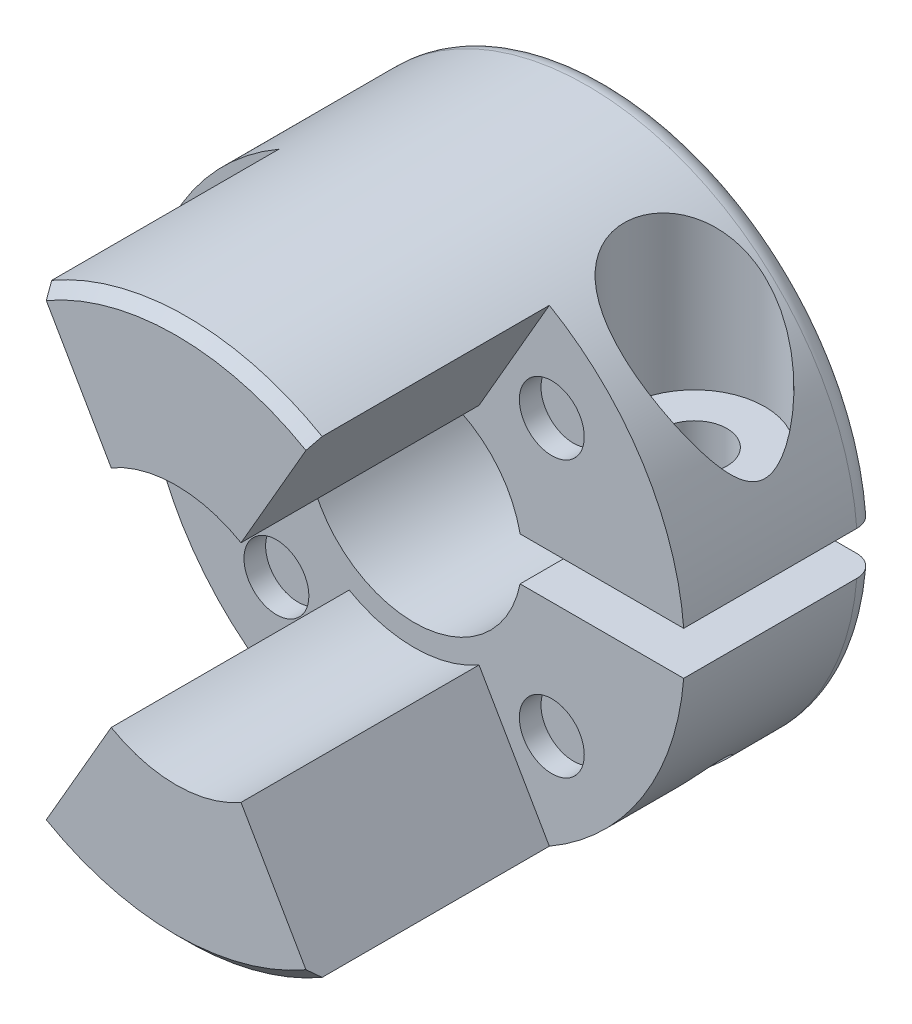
ISO-10303-21;
HEADER;
FILE_DESCRIPTION(('STEP AP214'),'2;1');
FILE_NAME('part.step','',(''),(''),'','','');
FILE_SCHEMA(('AUTOMOTIVE_DESIGN { 1 0 10303 214 1 1 1 1 }'));
ENDSEC;
DATA;
#1=APPLICATION_CONTEXT('core data for automotive mechanical design processes');
#2=APPLICATION_PROTOCOL_DEFINITION('international standard','automotive_design',2000,#1);
#3=PRODUCT_CONTEXT('',#1,'mechanical');
#4=PRODUCT('Part','Part','',(#3));
#5=PRODUCT_RELATED_PRODUCT_CATEGORY('part','',(#4));
#6=PRODUCT_DEFINITION_FORMATION('','',#4);
#7=PRODUCT_DEFINITION_CONTEXT('part definition',#1,'design');
#8=PRODUCT_DEFINITION('design','',#6,#7);
#9=PRODUCT_DEFINITION_SHAPE('','',#8);
#10=(LENGTH_UNIT() NAMED_UNIT(*) SI_UNIT(.MILLI.,.METRE.));
#11=(NAMED_UNIT(*) PLANE_ANGLE_UNIT() SI_UNIT($,.RADIAN.));
#12=(NAMED_UNIT(*) SI_UNIT($,.STERADIAN.) SOLID_ANGLE_UNIT());
#13=UNCERTAINTY_MEASURE_WITH_UNIT(LENGTH_MEASURE(1.E-05),#10,'distance_accuracy_value','');
#14=(GEOMETRIC_REPRESENTATION_CONTEXT(3) GLOBAL_UNCERTAINTY_ASSIGNED_CONTEXT((#13)) GLOBAL_UNIT_ASSIGNED_CONTEXT((#10,
#11,#12)) REPRESENTATION_CONTEXT('',''));
#15=CARTESIAN_POINT('',(0.,0.,0.));
#16=DIRECTION('',(0.,0.,1.));
#17=DIRECTION('',(1.,0.,0.));
#18=AXIS2_PLACEMENT_3D('',#15,#16,#17);
#19=CARTESIAN_POINT('',(8.45993579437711,4.,4.5));
#20=DIRECTION('',(0.,-1.,0.));
#21=DIRECTION('',(0.,0.,-1.));
#22=AXIS2_PLACEMENT_3D('',#19,#20,#21);
#23=PLANE('',#22);
#24=CARTESIAN_POINT('',(8.45993579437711,4.,4.5));
#25=DIRECTION('',(0.,-1.,0.));
#26=DIRECTION('',(0.,0.,-1.));
#27=AXIS2_PLACEMENT_3D('',#24,#25,#26);
#28=CIRCLE('',#27,3.25);
#29=CARTESIAN_POINT('',(8.45993579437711,4.,1.25));
#30=VERTEX_POINT('',#29);
#31=EDGE_CURVE('E476',#30,#30,#28,.F.);
#32=ORIENTED_EDGE('',*,*,#31,.T.);
#33=EDGE_LOOP('',(#32));
#34=FACE_BOUND('',#33,.T.);
#35=CARTESIAN_POINT('',(8.45993579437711,4.,4.5));
#36=DIRECTION('',(0.,1.,0.));
#37=DIRECTION('',(0.,0.,1.));
#38=AXIS2_PLACEMENT_3D('',#35,#36,#37);
#39=CIRCLE('',#38,1.5);
#40=CARTESIAN_POINT('',(8.45993579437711,4.,6.));
#41=VERTEX_POINT('',#40);
#42=EDGE_CURVE('E20',#41,#41,#39,.F.);
#43=ORIENTED_EDGE('',*,*,#42,.T.);
#44=EDGE_LOOP('',(#43));
#45=FACE_BOUND('',#44,.T.);
#46=ADVANCED_FACE('F17',(#34,#45),#23,.F.);
#47=CARTESIAN_POINT('',(6.36396103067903,6.36396103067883,8.));
#48=DIRECTION('',(0.,0.,1.));
#49=DIRECTION('',(1.,0.,0.));
#50=AXIS2_PLACEMENT_3D('',#47,#48,#49);
#51=PLANE('',#50);
#52=CARTESIAN_POINT('',(6.36396103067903,6.36396103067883,8.));
#53=DIRECTION('',(0.,0.,1.));
#54=DIRECTION('',(1.,0.,0.));
#55=AXIS2_PLACEMENT_3D('',#52,#53,#54);
#56=CIRCLE('',#55,1.5);
#57=CARTESIAN_POINT('',(7.86396103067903,6.36396103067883,8.));
#58=VERTEX_POINT('',#57);
#59=EDGE_CURVE('E713',#58,#58,#56,.T.);
#60=ORIENTED_EDGE('',*,*,#59,.T.);
#61=EDGE_LOOP('',(#60));
#62=FACE_BOUND('',#61,.T.);
#63=ADVANCED_FACE('F525',(#62),#51,.T.);
#64=CARTESIAN_POINT('',(-6.36396103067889,6.36396103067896,8.));
#65=DIRECTION('',(0.,0.,1.));
#66=DIRECTION('',(1.,0.,0.));
#67=AXIS2_PLACEMENT_3D('',#64,#65,#66);
#68=PLANE('',#67);
#69=CARTESIAN_POINT('',(-6.36396103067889,6.36396103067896,8.));
#70=DIRECTION('',(0.,0.,1.));
#71=DIRECTION('',(1.,0.,0.));
#72=AXIS2_PLACEMENT_3D('',#69,#70,#71);
#73=CIRCLE('',#72,1.5);
#74=CARTESIAN_POINT('',(-4.86396103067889,6.36396103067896,8.));
#75=VERTEX_POINT('',#74);
#76=EDGE_CURVE('E710',#75,#75,#73,.T.);
#77=ORIENTED_EDGE('',*,*,#76,.T.);
#78=EDGE_LOOP('',(#77));
#79=FACE_BOUND('',#78,.T.);
#80=ADVANCED_FACE('F518',(#79),#68,.T.);
#81=CARTESIAN_POINT('',(-6.36396103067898,-6.36396103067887,8.));
#82=DIRECTION('',(0.,0.,1.));
#83=DIRECTION('',(1.,0.,0.));
#84=AXIS2_PLACEMENT_3D('',#81,#82,#83);
#85=PLANE('',#84);
#86=CARTESIAN_POINT('',(-6.36396103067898,-6.36396103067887,8.));
#87=DIRECTION('',(0.,0.,1.));
#88=DIRECTION('',(1.,0.,0.));
#89=AXIS2_PLACEMENT_3D('',#86,#87,#88);
#90=CIRCLE('',#89,1.5);
#91=CARTESIAN_POINT('',(-4.86396103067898,-6.36396103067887,8.));
#92=VERTEX_POINT('',#91);
#93=EDGE_CURVE('E705',#92,#92,#90,.T.);
#94=ORIENTED_EDGE('',*,*,#93,.T.);
#95=EDGE_LOOP('',(#94));
#96=FACE_BOUND('',#95,.T.);
#97=ADVANCED_FACE('F511',(#96),#85,.T.);
#98=CARTESIAN_POINT('',(8.45993579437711,-12.501,4.5));
#99=DIRECTION('',(0.,1.,0.));
#100=DIRECTION('',(0.,0.,1.));
#101=AXIS2_PLACEMENT_3D('',#98,#99,#100);
#102=CYLINDRICAL_SURFACE('',#101,1.5);
#103=ORIENTED_EDGE('',*,*,#42,.F.);
#104=EDGE_LOOP('',(#103));
#105=FACE_BOUND('',#104,.T.);
#106=CARTESIAN_POINT('',(8.45993579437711,1.,4.5));
#107=DIRECTION('',(0.,1.,0.));
#108=DIRECTION('',(0.,0.,1.));
#109=AXIS2_PLACEMENT_3D('',#106,#107,#108);
#110=CIRCLE('',#109,1.5);
#111=CARTESIAN_POINT('',(8.45993579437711,1.,6.));
#112=VERTEX_POINT('',#111);
#113=EDGE_CURVE('E170',#112,#112,#110,.F.);
#114=ORIENTED_EDGE('',*,*,#113,.T.);
#115=EDGE_LOOP('',(#114));
#116=FACE_BOUND('',#115,.T.);
#117=ADVANCED_FACE('F306',(#105,#116),#102,.F.);
#118=CARTESIAN_POINT('',(0.,0.,0.));
#119=DIRECTION('',(0.,0.,-1.));
#120=DIRECTION('',(-1.,0.,0.));
#121=AXIS2_PLACEMENT_3D('',#118,#119,#120);
#122=CONICAL_SURFACE('',#121,5.49999999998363,0.785398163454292);
#123=CARTESIAN_POINT('',(0.,0.,0.500000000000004));
#124=DIRECTION('',(0.,0.,-1.));
#125=DIRECTION('',(-1.,0.,0.));
#126=AXIS2_PLACEMENT_3D('',#123,#124,#125);
#127=CIRCLE('',#126,5.);
#128=CARTESIAN_POINT('',(4.89897948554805,1.,0.499999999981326));
#129=VERTEX_POINT('',#128);
#130=CARTESIAN_POINT('',(4.89897948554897,-1.,0.499999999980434));
#131=VERTEX_POINT('',#130);
#132=EDGE_CURVE('E145',#129,#131,#127,.F.);
#133=ORIENTED_EDGE('',*,*,#132,.T.);
#134=CARTESIAN_POINT('',(5.40832691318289,-1.,-3.49652403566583E-12));
#135=CARTESIAN_POINT('',(5.32351054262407,-1.,0.0834095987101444));
#136=CARTESIAN_POINT('',(5.23865673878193,-1.,0.166781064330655));
#137=CARTESIAN_POINT('',(5.06887426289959,-1.,0.333447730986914));
#138=CARTESIAN_POINT('',(4.98394559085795,-1.,0.416742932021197));
#139=CARTESIAN_POINT('',(4.89897948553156,-1.,0.499999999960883));
#140=B_SPLINE_CURVE_WITH_KNOTS('',3,(#134,#135,#136,#137,#138,#139),.UNSPECIFIED.,.F.,.F.,(4,2,
4),(0.,0.356873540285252,0.713747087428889),.UNSPECIFIED.);
#141=CARTESIAN_POINT('',(5.40832691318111,-1.,-1.74825632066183E-12));
#142=VERTEX_POINT('',#141);
#143=EDGE_CURVE('E133',#142,#131,#140,.T.);
#144=ORIENTED_EDGE('',*,*,#143,.F.);
#145=CARTESIAN_POINT('',(0.,0.,0.));
#146=DIRECTION('',(0.,0.,-1.));
#147=DIRECTION('',(-1.,0.,0.));
#148=AXIS2_PLACEMENT_3D('',#145,#146,#147);
#149=CIRCLE('',#148,5.49999999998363);
#150=CARTESIAN_POINT('',(5.40832691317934,1.,0.));
#151=VERTEX_POINT('',#150);
#152=EDGE_CURVE('E127',#142,#151,#149,.T.);
#153=ORIENTED_EDGE('',*,*,#152,.T.);
#154=CARTESIAN_POINT('',(5.40832691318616,1.,-6.71546443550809E-12));
#155=CARTESIAN_POINT('',(5.32351054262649,1.,0.0834095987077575));
#156=CARTESIAN_POINT('',(5.23865673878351,1.,0.1667810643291));
#157=CARTESIAN_POINT('',(5.06887426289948,1.,0.33344773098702));
#158=CARTESIAN_POINT('',(4.98394559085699,1.,0.416742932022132));
#159=CARTESIAN_POINT('',(4.89897948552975,1.,0.499999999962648));
#160=B_SPLINE_CURVE_WITH_KNOTS('',3,(#154,#155,#156,#157,#158,#159),.UNSPECIFIED.,.F.,.F.,(4,2,
4),(0.,0.356873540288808,0.713747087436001),.UNSPECIFIED.);
#161=EDGE_CURVE('E148',#151,#129,#160,.T.);
#162=ORIENTED_EDGE('',*,*,#161,.T.);
#163=EDGE_LOOP('',(#133,#144,#153,#162));
#164=FACE_BOUND('',#163,.T.);
#165=ADVANCED_FACE('F146',(#164),#122,.F.);
#166=CARTESIAN_POINT('',(0.,0.,20.));
#167=DIRECTION('',(0.,0.,1.));
#168=DIRECTION('',(1.,0.,0.));
#169=AXIS2_PLACEMENT_3D('',#166,#167,#168);
#170=PLANE('',#169);
#171=CARTESIAN_POINT('',(0.,0.,20.));
#172=DIRECTION('',(0.,0.,-1.));
#173=DIRECTION('',(-1.,0.,0.));
#174=AXIS2_PLACEMENT_3D('',#171,#172,#173);
#175=CIRCLE('',#174,12.);
#176=CARTESIAN_POINT('',(-6.00000000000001,10.3923048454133,20.));
#177=VERTEX_POINT('',#176);
#178=CARTESIAN_POINT('',(6.00000000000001,10.3923048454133,20.));
#179=VERTEX_POINT('',#178);
#180=EDGE_CURVE('E143',#177,#179,#175,.T.);
#181=ORIENTED_EDGE('',*,*,#180,.F.);
#182=DIRECTION('',(0.500000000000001,-0.866025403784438,0.));
#183=VECTOR('',#182,1.);
#184=CARTESIAN_POINT('',(0.,0.,20.));
#185=LINE('',#184,#183);
#186=CARTESIAN_POINT('',(-3.,5.19615242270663,20.));
#187=VERTEX_POINT('',#186);
#188=EDGE_CURVE('E152',#187,#177,#185,.F.);
#189=ORIENTED_EDGE('',*,*,#188,.F.);
#190=CARTESIAN_POINT('',(0.,0.,20.));
#191=DIRECTION('',(0.,0.,1.));
#192=DIRECTION('',(1.,0.,0.));
#193=AXIS2_PLACEMENT_3D('',#190,#191,#192);
#194=CIRCLE('',#193,6.);
#195=CARTESIAN_POINT('',(3.00000000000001,5.19615242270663,20.));
#196=VERTEX_POINT('',#195);
#197=EDGE_CURVE('E299',#187,#196,#194,.F.);
#198=ORIENTED_EDGE('',*,*,#197,.T.);
#199=DIRECTION('',(-0.500000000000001,-0.866025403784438,0.));
#200=VECTOR('',#199,1.);
#201=CARTESIAN_POINT('',(0.,0.,20.));
#202=LINE('',#201,#200);
#203=EDGE_CURVE('E386',#196,#179,#202,.F.);
#204=ORIENTED_EDGE('',*,*,#203,.T.);
#205=EDGE_LOOP('',(#181,#189,#198,#204));
#206=FACE_BOUND('',#205,.T.);
#207=ADVANCED_FACE('F305',(#206),#170,.T.);
#208=CARTESIAN_POINT('',(6.36396103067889,-6.36396103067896,8.));
#209=DIRECTION('',(0.,0.,1.));
#210=DIRECTION('',(1.,0.,0.));
#211=AXIS2_PLACEMENT_3D('',#208,#209,#210);
#212=PLANE('',#211);
#213=CARTESIAN_POINT('',(6.36396103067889,-6.36396103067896,8.));
#214=DIRECTION('',(0.,0.,1.));
#215=DIRECTION('',(1.,0.,0.));
#216=AXIS2_PLACEMENT_3D('',#213,#214,#215);
#217=CIRCLE('',#216,1.5);
#218=CARTESIAN_POINT('',(7.86396103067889,-6.36396103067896,8.));
#219=VERTEX_POINT('',#218);
#220=EDGE_CURVE('E397',#219,#219,#217,.T.);
#221=ORIENTED_EDGE('',*,*,#220,.T.);
#222=EDGE_LOOP('',(#221));
#223=FACE_BOUND('',#222,.T.);
#224=ADVANCED_FACE('F490',(#223),#212,.T.);
#225=CARTESIAN_POINT('',(0.,0.,19.5));
#226=DIRECTION('',(0.,0.,-1.));
#227=DIRECTION('',(-1.,0.,0.));
#228=AXIS2_PLACEMENT_3D('',#225,#226,#227);
#229=CONICAL_SURFACE('',#228,12.5,0.785398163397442);
#230=DIRECTION('',(-0.353553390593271,0.612372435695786,-0.707106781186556));
#231=VECTOR('',#230,1.);
#232=CARTESIAN_POINT('',(-6.00000000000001,10.3923048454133,20.));
#233=LINE('',#232,#231);
#234=CARTESIAN_POINT('',(-6.25000000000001,10.8253175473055,19.5));
#235=VERTEX_POINT('',#234);
#236=EDGE_CURVE('E390',#177,#235,#233,.T.);
#237=ORIENTED_EDGE('',*,*,#236,.F.);
#238=ORIENTED_EDGE('',*,*,#180,.T.);
#239=DIRECTION('',(0.353553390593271,0.612372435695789,-0.707106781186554));
#240=VECTOR('',#239,1.);
#241=CARTESIAN_POINT('',(6.00000000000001,10.3923048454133,20.));
#242=LINE('',#241,#240);
#243=CARTESIAN_POINT('',(6.25000000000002,10.8253175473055,19.5));
#244=VERTEX_POINT('',#243);
#245=EDGE_CURVE('E387',#179,#244,#242,.T.);
#246=ORIENTED_EDGE('',*,*,#245,.T.);
#247=CARTESIAN_POINT('',(0.,0.,19.5));
#248=DIRECTION('',(0.,0.,-1.));
#249=DIRECTION('',(-1.,0.,0.));
#250=AXIS2_PLACEMENT_3D('',#247,#248,#249);
#251=CIRCLE('',#250,12.5);
#252=EDGE_CURVE('E176',#235,#244,#251,.T.);
#253=ORIENTED_EDGE('',*,*,#252,.F.);
#254=EDGE_LOOP('',(#237,#238,#246,#253));
#255=FACE_BOUND('',#254,.T.);
#256=ADVANCED_FACE('F206',(#255),#229,.T.);
#257=CARTESIAN_POINT('',(8.45993579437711,12.5,4.5));
#258=DIRECTION('',(0.,-1.,0.));
#259=DIRECTION('',(0.,0.,-1.));
#260=AXIS2_PLACEMENT_3D('',#257,#258,#259);
#261=CYLINDRICAL_SURFACE('',#260,3.25);
#262=ORIENTED_EDGE('',*,*,#31,.F.);
#263=EDGE_LOOP('',(#262));
#264=FACE_BOUND('',#263,.T.);
#265=CARTESIAN_POINT('',(8.45993579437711,9.20214574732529,7.75));
#266=CARTESIAN_POINT('',(8.35821897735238,9.29565821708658,7.74999972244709));
#267=CARTESIAN_POINT('',(8.25494097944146,9.38748858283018,7.74522625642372));
#268=CARTESIAN_POINT('',(8.04598618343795,9.56718824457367,7.72523800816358));
#269=CARTESIAN_POINT('',(7.94030986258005,9.65505831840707,7.71002528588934));
#270=CARTESIAN_POINT('',(7.72749590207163,9.82621121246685,7.66824494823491));
#271=CARTESIAN_POINT('',(7.62035868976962,9.9094953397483,7.64168058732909));
#272=CARTESIAN_POINT('',(7.40591408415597,10.0707730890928,7.57638048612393));
#273=CARTESIAN_POINT('',(7.29860678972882,10.1487690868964,7.53765025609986));
#274=CARTESIAN_POINT('',(7.03686498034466,10.3328714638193,7.42670784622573));
#275=CARTESIAN_POINT('',(6.88305827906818,10.4357437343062,7.34727475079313));
#276=CARTESIAN_POINT('',(6.65895554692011,10.5790490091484,7.20680258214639));
#277=CARTESIAN_POINT('',(6.5853393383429,10.624993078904,7.15641042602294));
#278=CARTESIAN_POINT('',(6.44110431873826,10.7130425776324,7.04851214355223));
#279=CARTESIAN_POINT('',(6.37048409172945,10.7551498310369,6.9910094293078));
#280=CARTESIAN_POINT('',(6.2326296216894,10.8356242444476,6.86857922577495));
#281=CARTESIAN_POINT('',(6.16542240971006,10.8739632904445,6.80360277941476));
#282=CARTESIAN_POINT('',(6.03586823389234,10.9464057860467,6.66685512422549));
#283=CARTESIAN_POINT('',(5.97351904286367,10.9805111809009,6.5950870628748));
#284=CARTESIAN_POINT('',(5.85454810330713,11.0444026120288,6.44515148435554));
#285=CARTESIAN_POINT('',(5.79792661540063,11.0741884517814,6.36698367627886));
#286=CARTESIAN_POINT('',(5.69127349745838,11.1293761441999,6.204823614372));
#287=CARTESIAN_POINT('',(5.64124110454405,11.1547785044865,6.12083203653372));
#288=CARTESIAN_POINT('',(5.55353632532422,11.1986773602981,5.95705817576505));
#289=CARTESIAN_POINT('',(5.51511306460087,11.217623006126,5.87779716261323));
#290=CARTESIAN_POINT('',(5.44459450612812,11.2520189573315,5.71574190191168));
#291=CARTESIAN_POINT('',(5.41250132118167,11.2674680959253,5.63294648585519));
#292=CARTESIAN_POINT('',(5.3550891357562,11.2948676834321,5.46453697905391));
#293=CARTESIAN_POINT('',(5.32976537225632,11.3068205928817,5.37892491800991));
#294=CARTESIAN_POINT('',(5.28617367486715,11.3272651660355,5.20551016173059));
#295=CARTESIAN_POINT('',(5.26790825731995,11.3357555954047,5.11770669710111));
#296=CARTESIAN_POINT('',(5.22590123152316,11.3552171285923,4.86302109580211));
#297=CARTESIAN_POINT('',(5.21135213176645,11.3618584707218,4.69416884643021));
#298=CARTESIAN_POINT('',(5.2087155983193,11.3630659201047,4.35632654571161));
#299=CARTESIAN_POINT('',(5.22062360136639,11.3576341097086,4.18733652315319));
#300=CARTESIAN_POINT('',(5.26993344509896,11.3348363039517,3.85667080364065));
#301=CARTESIAN_POINT('',(5.30693134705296,11.3176593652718,3.69492186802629));
#302=CARTESIAN_POINT('',(5.40440504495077,11.2714369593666,3.38047669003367));
#303=CARTESIAN_POINT('',(5.46488016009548,11.2423918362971,3.22778018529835));
#304=CARTESIAN_POINT('',(5.60748178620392,11.1719518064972,2.93379875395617));
#305=CARTESIAN_POINT('',(5.68983896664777,11.1304246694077,2.79265770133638));
#306=CARTESIAN_POINT('',(5.87232738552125,11.0352314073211,2.52698978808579));
#307=CARTESIAN_POINT('',(5.97246015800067,10.981564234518,2.40246436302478));
#308=CARTESIAN_POINT('',(6.19121687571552,10.8597953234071,2.16711092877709));
#309=CARTESIAN_POINT('',(6.31046922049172,10.7911536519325,2.05714901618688));
#310=CARTESIAN_POINT('',(6.55909725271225,10.6418643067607,1.85905038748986));
#311=CARTESIAN_POINT('',(6.68847684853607,10.561211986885,1.77092215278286));
#312=CARTESIAN_POINT('',(6.9662448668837,10.3803453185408,1.60866526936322));
#313=CARTESIAN_POINT('',(7.11523108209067,10.2789768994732,1.5368597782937));
#314=CARTESIAN_POINT('',(7.41493103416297,10.064926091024,1.41836655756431));
#315=CARTESIAN_POINT('',(7.56564513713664,9.95224126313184,1.37168425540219));
#316=CARTESIAN_POINT('',(7.84201168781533,9.7354435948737,1.30662647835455));
#317=CARTESIAN_POINT('',(7.96797145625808,9.63265590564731,1.28501348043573));
#318=CARTESIAN_POINT('',(8.21666397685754,9.42141389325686,1.25670286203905));
#319=CARTESIAN_POINT('',(8.33939768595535,9.31296127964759,1.250000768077));
#320=CARTESIAN_POINT('',(8.58766118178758,9.08472266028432,1.24999918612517));
#321=CARTESIAN_POINT('',(8.71292132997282,8.96464646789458,1.25752267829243));
#322=CARTESIAN_POINT('',(8.95762699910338,8.72014139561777,1.28597018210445));
#323=CARTESIAN_POINT('',(9.07706884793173,8.59570984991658,1.30690254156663));
#324=CARTESIAN_POINT('',(9.30986513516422,8.34302266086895,1.36082076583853));
#325=CARTESIAN_POINT('',(9.42319713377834,8.21475529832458,1.39384799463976));
#326=CARTESIAN_POINT('',(9.6429538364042,7.95564627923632,1.47072334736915));
#327=CARTESIAN_POINT('',(9.74937946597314,7.82480497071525,1.51457001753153));
#328=CARTESIAN_POINT('',(9.98152669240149,7.52749667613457,1.62463305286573));
#329=CARTESIAN_POINT('',(10.1052088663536,7.36048832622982,1.69370251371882));
#330=CARTESIAN_POINT('',(10.3412895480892,7.0249453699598,1.84617814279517));
#331=CARTESIAN_POINT('',(10.4536815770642,6.8564099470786,1.92959246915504));
#332=CARTESIAN_POINT('',(10.6670773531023,6.51944674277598,2.11031221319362));
#333=CARTESIAN_POINT('',(10.7680781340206,6.35101900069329,2.20762123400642));
#334=CARTESIAN_POINT('',(10.9107941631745,6.10031445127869,2.36440510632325));
#335=CARTESIAN_POINT('',(10.9568902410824,6.01709226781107,2.41845305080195));
#336=CARTESIAN_POINT('',(11.0461198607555,5.85167120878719,2.53041095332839));
#337=CARTESIAN_POINT('',(11.089253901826,5.76947216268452,2.58832025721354));
#338=CARTESIAN_POINT('',(11.1715290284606,5.6084691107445,2.70699773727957));
#339=CARTESIAN_POINT('',(11.2107385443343,5.52963039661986,2.76767113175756));
#340=CARTESIAN_POINT('',(11.2860938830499,5.37415476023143,2.89354049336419));
#341=CARTESIAN_POINT('',(11.3222407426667,5.29751709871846,2.95873491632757));
#342=CARTESIAN_POINT('',(11.39108980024,5.14779839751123,3.09409127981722));
#343=CARTESIAN_POINT('',(11.4238067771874,5.07470289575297,3.16422952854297));
#344=CARTESIAN_POINT('',(11.4855505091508,4.93336129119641,3.31068412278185));
#345=CARTESIAN_POINT('',(11.5145811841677,4.86511007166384,3.38699376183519));
#346=CARTESIAN_POINT('',(11.5631833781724,4.74826365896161,3.53199378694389));
#347=CARTESIAN_POINT('',(11.5835051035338,4.69839378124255,3.59939042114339));
#348=CARTESIAN_POINT('',(11.6206651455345,4.60571730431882,3.74001017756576));
#349=CARTESIAN_POINT('',(11.6374992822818,4.56291919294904,3.81324014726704));
#350=CARTESIAN_POINT('',(11.6669140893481,4.48718124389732,3.96707654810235));
#351=CARTESIAN_POINT('',(11.6794252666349,4.45440336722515,4.04777920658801));
#352=CARTESIAN_POINT('',(11.698437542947,4.40423818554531,4.21442004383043));
#353=CARTESIAN_POINT('',(11.7049624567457,4.3867899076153,4.30033601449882));
#354=CARTESIAN_POINT('',(11.7106387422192,4.37161297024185,4.46386054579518));
#355=CARTESIAN_POINT('',(11.7105748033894,4.37178573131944,4.54124178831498));
#356=CARTESIAN_POINT('',(11.7050225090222,4.38662750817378,4.69444310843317));
#357=CARTESIAN_POINT('',(11.6995262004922,4.40131777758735,4.7702607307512));
#358=CARTESIAN_POINT('',(11.6827069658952,4.44578212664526,4.92830871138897));
#359=CARTESIAN_POINT('',(11.6706682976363,4.47739982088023,5.00992375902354));
#360=CARTESIAN_POINT('',(11.6417891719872,4.55195933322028,5.16687100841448));
#361=CARTESIAN_POINT('',(11.624937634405,4.59492726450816,5.24218818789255));
#362=CARTESIAN_POINT('',(11.589096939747,4.68454554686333,5.38063438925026));
#363=CARTESIAN_POINT('',(11.5704101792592,4.73057476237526,5.44425536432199));
#364=CARTESIAN_POINT('',(11.5304348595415,4.8271947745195,5.56710418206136));
#365=CARTESIAN_POINT('',(11.5091439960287,4.87778960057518,5.62632805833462));
#366=CARTESIAN_POINT('',(11.4642791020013,4.98232354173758,5.741057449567));
#367=CARTESIAN_POINT('',(11.440700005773,5.03626997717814,5.79655423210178));
#368=CARTESIAN_POINT('',(11.3915219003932,5.14654116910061,5.90420746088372));
#369=CARTESIAN_POINT('',(11.3659221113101,5.20286683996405,5.95636260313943));
#370=CARTESIAN_POINT('',(11.2810020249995,5.38592328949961,6.1186418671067));
#371=CARTESIAN_POINT('',(11.2181049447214,5.51597484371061,6.2231668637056));
#372=CARTESIAN_POINT('',(11.0841656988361,5.78042831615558,6.42097642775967));
#373=CARTESIAN_POINT('',(11.0131151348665,5.9148346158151,6.51424919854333));
#374=CARTESIAN_POINT('',(10.8631139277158,6.18601667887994,6.69104753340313));
#375=CARTESIAN_POINT('',(10.7841501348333,6.32279606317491,6.77455635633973));
#376=CARTESIAN_POINT('',(10.6185712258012,6.59709241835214,6.93225338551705));
#377=CARTESIAN_POINT('',(10.531955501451,6.73460944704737,7.00644084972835));
#378=CARTESIAN_POINT('',(10.341891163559,7.02339938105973,7.15264986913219));
#379=CARTESIAN_POINT('',(10.2376269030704,7.17464200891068,7.22367545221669));
#380=CARTESIAN_POINT('',(10.0199127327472,7.47568521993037,7.35395594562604));
#381=CARTESIAN_POINT('',(9.90645970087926,7.62548529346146,7.4132068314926));
#382=CARTESIAN_POINT('',(9.67104186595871,7.92190783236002,7.51865655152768));
#383=CARTESIAN_POINT('',(9.54911459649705,8.0685409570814,7.56490887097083));
#384=CARTESIAN_POINT('',(9.29672331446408,8.35809574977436,7.64320306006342));
#385=CARTESIAN_POINT('',(9.16626584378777,8.50102014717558,7.67525567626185));
#386=CARTESIAN_POINT('',(8.94007689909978,8.73742923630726,7.71568841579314));
#387=CARTESIAN_POINT('',(8.84645681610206,8.83221541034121,7.72835248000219));
#388=CARTESIAN_POINT('',(8.65569538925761,9.0192458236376,7.74551416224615));
#389=CARTESIAN_POINT('',(8.55854927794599,9.11148630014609,7.7500002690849));
#390=CARTESIAN_POINT('',(8.45993579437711,9.20214574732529,7.75));
#391=B_SPLINE_CURVE_WITH_KNOTS('',3,(#265,#266,#267,#268,#269,#270,#271,#272,#273,#274,#275,
#276,#277,#278,#279,#280,#281,#282,#283,#284,#285,#286,#287,#288,#289,#290,#291,#292,#293,#294,
#295,#296,#297,#298,#299,#300,#301,#302,#303,#304,#305,#306,#307,#308,#309,#310,#311,#312,#313,
#314,#315,#316,#317,#318,#319,#320,#321,#322,#323,#324,#325,#326,#327,#328,#329,#330,#331,#332,
#333,#334,#335,#336,#337,#338,#339,#340,#341,#342,#343,#344,#345,#346,#347,#348,#349,#350,#351,
#352,#353,#354,#355,#356,#357,#358,#359,#360,#361,#362,#363,#364,#365,#366,#367,#368,#369,#370,
#371,#372,#373,#374,#375,#376,#377,#378,#379,#380,#381,#382,#383,#384,#385,#386,#387,#388,#389,
#390),.UNSPECIFIED.,.T.,.F.,(4,2,2,2,2,2,2,2,2,2,2,2,2,2,2,2,2,2,2,2,2,2,2,2,2,2,2,2,2,2,2,2,2,
2,2,2,2,2,2,2,2,2,2,2,2,2,2,2,2,2,2,2,2,2,2,2,2,2,2,2,2,2,4),(0.,0.414407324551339,
0.828732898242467,1.24293976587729,1.65695929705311,2.25816551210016,2.55890996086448,
2.85951064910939,3.16220652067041,3.46476279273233,3.7673328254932,4.06986779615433,
4.33981172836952,4.60984560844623,4.87968898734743,5.14962847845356,5.65576212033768,
6.16180847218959,6.65989521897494,7.15796752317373,7.66151425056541,8.16510445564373,
8.69130663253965,9.21771289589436,9.7974549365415,10.3773221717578,10.8684959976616,
11.359522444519,11.879827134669,12.4004560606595,12.9228824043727,13.4452385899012,
14.1013844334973,14.757904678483,15.4145954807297,15.7427561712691,16.0708614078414,
16.3915159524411,16.7120615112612,17.0311635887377,17.3499234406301,17.6083186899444,
17.8670218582,18.1297089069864,18.3913463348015,18.6218652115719,18.8527220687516,
19.1163167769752,19.3805232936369,19.6223279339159,19.8643481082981,20.106916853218,
20.3495796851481,20.8836489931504,21.4182734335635,21.9538014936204,22.4893721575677,
23.0796701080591,23.6701694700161,24.2582022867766,24.8457893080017,25.2469889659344,
25.6487529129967),.UNSPECIFIED.);
#392=CARTESIAN_POINT('',(8.45993579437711,9.20214574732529,7.75));
#393=VERTEX_POINT('',#392);
#394=EDGE_CURVE('E181',#393,#393,#391,.T.);
#395=ORIENTED_EDGE('',*,*,#394,.F.);
#396=EDGE_LOOP('',(#395));
#397=FACE_BOUND('',#396,.T.);
#398=ADVANCED_FACE('F201',(#264,#397),#261,.F.);
#399=CARTESIAN_POINT('',(0.,0.,0.));
#400=DIRECTION('',(0.,0.,1.));
#401=DIRECTION('',(1.,0.,0.));
#402=AXIS2_PLACEMENT_3D('',#399,#400,#401);
#403=PLANE('',#402);
#404=ORIENTED_EDGE('',*,*,#152,.F.);
#405=DIRECTION('',(1.,0.,0.));
#406=VECTOR('',#405,1.);
#407=CARTESIAN_POINT('',(1.,-1.,0.));
#408=LINE('',#407,#406);
#409=CARTESIAN_POINT('',(11.4564392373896,-1.,0.));
#410=VERTEX_POINT('',#409);
#411=EDGE_CURVE('E141',#142,#410,#408,.T.);
#412=ORIENTED_EDGE('',*,*,#411,.T.);
#413=CARTESIAN_POINT('',(0.,0.,0.));
#414=DIRECTION('',(0.,0.,1.));
#415=DIRECTION('',(0.996212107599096,0.0869565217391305,0.));
#416=AXIS2_PLACEMENT_3D('',#413,#414,#415);
#417=CIRCLE('',#416,11.5);
#418=CARTESIAN_POINT('',(11.4564392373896,1.,0.));
#419=VERTEX_POINT('',#418);
#420=EDGE_CURVE('E184',#419,#410,#417,.T.);
#421=ORIENTED_EDGE('',*,*,#420,.F.);
#422=DIRECTION('',(1.,0.,0.));
#423=VECTOR('',#422,1.);
#424=CARTESIAN_POINT('',(1.,1.,0.));
#425=LINE('',#424,#423);
#426=EDGE_CURVE('E168',#419,#151,#425,.F.);
#427=ORIENTED_EDGE('',*,*,#426,.T.);
#428=EDGE_LOOP('',(#404,#412,#421,#427));
#429=FACE_BOUND('',#428,.T.);
#430=ADVANCED_FACE('F190',(#429),#403,.F.);
#431=CARTESIAN_POINT('',(6.36396103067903,6.36396103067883,8.));
#432=DIRECTION('',(0.,0.,1.));
#433=DIRECTION('',(1.,0.,0.));
#434=AXIS2_PLACEMENT_3D('',#431,#432,#433);
#435=CYLINDRICAL_SURFACE('',#434,1.5);
#436=ORIENTED_EDGE('',*,*,#59,.F.);
#437=EDGE_LOOP('',(#436));
#438=FACE_BOUND('',#437,.T.);
#439=CARTESIAN_POINT('',(6.36396103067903,6.36396103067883,9.));
#440=DIRECTION('',(0.,0.,1.));
#441=DIRECTION('',(1.,0.,0.));
#442=AXIS2_PLACEMENT_3D('',#439,#440,#441);
#443=CIRCLE('',#442,1.5);
#444=CARTESIAN_POINT('',(7.86396103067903,6.36396103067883,9.));
#445=VERTEX_POINT('',#444);
#446=EDGE_CURVE('E159',#445,#445,#443,.T.);
#447=ORIENTED_EDGE('',*,*,#446,.T.);
#448=EDGE_LOOP('',(#447));
#449=FACE_BOUND('',#448,.T.);
#450=ADVANCED_FACE('F200',(#438,#449),#435,.F.);
#451=CARTESIAN_POINT('',(-6.36396103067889,6.36396103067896,8.));
#452=DIRECTION('',(0.,0.,1.));
#453=DIRECTION('',(1.,0.,0.));
#454=AXIS2_PLACEMENT_3D('',#451,#452,#453);
#455=CYLINDRICAL_SURFACE('',#454,1.5);
#456=ORIENTED_EDGE('',*,*,#76,.F.);
#457=EDGE_LOOP('',(#456));
#458=FACE_BOUND('',#457,.T.);
#459=CARTESIAN_POINT('',(-6.36396103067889,6.36396103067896,9.));
#460=DIRECTION('',(0.,0.,1.));
#461=DIRECTION('',(1.,0.,0.));
#462=AXIS2_PLACEMENT_3D('',#459,#460,#461);
#463=CIRCLE('',#462,1.5);
#464=CARTESIAN_POINT('',(-4.86396103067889,6.36396103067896,9.));
#465=VERTEX_POINT('',#464);
#466=EDGE_CURVE('E452',#465,#465,#463,.T.);
#467=ORIENTED_EDGE('',*,*,#466,.T.);
#468=EDGE_LOOP('',(#467));
#469=FACE_BOUND('',#468,.T.);
#470=ADVANCED_FACE('F584',(#458,#469),#455,.F.);
#471=CARTESIAN_POINT('',(-6.36396103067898,-6.36396103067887,8.));
#472=DIRECTION('',(0.,0.,1.));
#473=DIRECTION('',(1.,0.,0.));
#474=AXIS2_PLACEMENT_3D('',#471,#472,#473);
#475=CYLINDRICAL_SURFACE('',#474,1.5);
#476=ORIENTED_EDGE('',*,*,#93,.F.);
#477=EDGE_LOOP('',(#476));
#478=FACE_BOUND('',#477,.T.);
#479=CARTESIAN_POINT('',(-6.36396103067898,-6.36396103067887,9.));
#480=DIRECTION('',(0.,0.,1.));
#481=DIRECTION('',(1.,0.,0.));
#482=AXIS2_PLACEMENT_3D('',#479,#480,#481);
#483=CIRCLE('',#482,1.5);
#484=CARTESIAN_POINT('',(-4.86396103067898,-6.36396103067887,9.));
#485=VERTEX_POINT('',#484);
#486=EDGE_CURVE('E448',#485,#485,#483,.T.);
#487=ORIENTED_EDGE('',*,*,#486,.T.);
#488=EDGE_LOOP('',(#487));
#489=FACE_BOUND('',#488,.T.);
#490=ADVANCED_FACE('F288',(#478,#489),#475,.F.);
#491=CARTESIAN_POINT('',(1.,1.,0.));
#492=DIRECTION('',(0.,1.,0.));
#493=DIRECTION('',(0.,0.,1.));
#494=AXIS2_PLACEMENT_3D('',#491,#492,#493);
#495=PLANE('',#494);
#496=ORIENTED_EDGE('',*,*,#161,.F.);
#497=ORIENTED_EDGE('',*,*,#426,.F.);
#498=CARTESIAN_POINT('',(12.4599357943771,1.,1.));
#499=CARTESIAN_POINT('',(12.4599356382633,1.,0.97193237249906));
#500=CARTESIAN_POINT('',(12.458749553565,1.,0.943878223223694));
#501=CARTESIAN_POINT('',(12.4540180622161,1.,0.887971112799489));
#502=CARTESIAN_POINT('',(12.4504727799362,1.,0.860118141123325));
#503=CARTESIAN_POINT('',(12.4363331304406,1.,0.777213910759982));
#504=CARTESIAN_POINT('',(12.4222348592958,1.,0.722718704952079));
#505=CARTESIAN_POINT('',(12.3850929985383,1.,0.616871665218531));
#506=CARTESIAN_POINT('',(12.3620453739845,1.,0.565521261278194));
#507=CARTESIAN_POINT('',(12.3076678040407,1.,0.467411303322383));
#508=CARTESIAN_POINT('',(12.2763391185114,1.,0.420651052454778));
#509=CARTESIAN_POINT('',(12.2062539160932,1.,0.332977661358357));
#510=CARTESIAN_POINT('',(12.1674868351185,1.,0.29207298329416));
#511=CARTESIAN_POINT('',(12.0836282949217,1.,0.217315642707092));
#512=CARTESIAN_POINT('',(12.0385367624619,1.,0.183463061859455));
#513=CARTESIAN_POINT('',(11.9670943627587,1.,0.138656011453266));
#514=CARTESIAN_POINT('',(11.942584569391,1.,0.124690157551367));
#515=CARTESIAN_POINT('',(11.8925032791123,1.,0.098877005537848));
#516=CARTESIAN_POINT('',(11.8669327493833,1.,0.0870278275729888));
#517=CARTESIAN_POINT('',(11.7888639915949,1.,0.0547755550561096));
#518=CARTESIAN_POINT('',(11.7349617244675,1.,0.0376383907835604));
#519=CARTESIAN_POINT('',(11.6433732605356,1.,0.016777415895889));
#520=CARTESIAN_POINT('',(11.6062406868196,1.,0.0104897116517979));
#521=CARTESIAN_POINT('',(11.5315591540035,0.999999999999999,0.00210262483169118));
#522=CARTESIAN_POINT('',(11.4940108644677,0.999999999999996,-2.71982559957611E-06));
#523=CARTESIAN_POINT('',(11.4564392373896,0.99999999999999,0.));
#524=B_SPLINE_CURVE_WITH_KNOTS('',3,(#498,#499,#500,#501,#502,#503,#504,#505,#506,#507,#508,
#509,#510,#511,#512,#513,#514,#515,#516,#517,#518,#519,#520,#521,#522,#523),.UNSPECIFIED.,.F.,
.F.,(4,2,2,2,2,2,2,2,2,2,2,2,4),(0.,0.084151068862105,0.168297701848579,0.336298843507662,
0.504375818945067,0.672427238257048,0.840719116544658,1.009012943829,1.09355406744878,
1.17801973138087,1.34678722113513,1.45955810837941,1.57216812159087),.UNSPECIFIED.);
#525=CARTESIAN_POINT('',(12.4599357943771,1.,1.));
#526=VERTEX_POINT('',#525);
#527=EDGE_CURVE('E217',#526,#419,#524,.T.);
#528=ORIENTED_EDGE('',*,*,#527,.F.);
#529=DIRECTION('',(0.,0.,-1.));
#530=VECTOR('',#529,1.);
#531=CARTESIAN_POINT('',(12.4599357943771,0.999999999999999,20.));
#532=LINE('',#531,#530);
#533=CARTESIAN_POINT('',(12.4599357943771,1.,9.));
#534=VERTEX_POINT('',#533);
#535=EDGE_CURVE('E175',#534,#526,#532,.T.);
#536=ORIENTED_EDGE('',*,*,#535,.F.);
#537=DIRECTION('',(-1.,0.,0.));
#538=VECTOR('',#537,1.);
#539=CARTESIAN_POINT('',(0.,1.,9.));
#540=LINE('',#539,#538);
#541=CARTESIAN_POINT('',(4.89897948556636,1.,9.));
#542=VERTEX_POINT('',#541);
#543=EDGE_CURVE('E443',#534,#542,#540,.T.);
#544=ORIENTED_EDGE('',*,*,#543,.T.);
#545=DIRECTION('',(0.,0.,-1.));
#546=VECTOR('',#545,1.);
#547=CARTESIAN_POINT('',(4.89897948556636,1.,20.));
#548=LINE('',#547,#546);
#549=EDGE_CURVE('E153',#542,#129,#548,.T.);
#550=ORIENTED_EDGE('',*,*,#549,.T.);
#551=EDGE_LOOP('',(#496,#497,#528,#536,#544,#550));
#552=FACE_BOUND('',#551,.T.);
#553=ORIENTED_EDGE('',*,*,#113,.F.);
#554=EDGE_LOOP('',(#553));
#555=FACE_BOUND('',#554,.T.);
#556=ADVANCED_FACE('F284',(#552,#555),#495,.F.);
#557=CARTESIAN_POINT('',(0.,0.,20.));
#558=DIRECTION('',(0.,0.,-1.));
#559=DIRECTION('',(-1.,0.,0.));
#560=AXIS2_PLACEMENT_3D('',#557,#558,#559);
#561=CYLINDRICAL_SURFACE('',#560,5.);
#562=CARTESIAN_POINT('',(0.,0.,9.));
#563=DIRECTION('',(0.,0.,-1.));
#564=DIRECTION('',(-1.,0.,0.));
#565=AXIS2_PLACEMENT_3D('',#562,#563,#564);
#566=CIRCLE('',#565,5.);
#567=CARTESIAN_POINT('',(4.89897948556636,-1.,9.));
#568=VERTEX_POINT('',#567);
#569=EDGE_CURVE('E156',#542,#568,#566,.F.);
#570=ORIENTED_EDGE('',*,*,#569,.T.);
#571=DIRECTION('',(0.,0.,-1.));
#572=VECTOR('',#571,1.);
#573=CARTESIAN_POINT('',(4.89897948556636,-1.,0.));
#574=LINE('',#573,#572);
#575=EDGE_CURVE('E138',#568,#131,#574,.T.);
#576=ORIENTED_EDGE('',*,*,#575,.T.);
#577=ORIENTED_EDGE('',*,*,#132,.F.);
#578=ORIENTED_EDGE('',*,*,#549,.F.);
#579=EDGE_LOOP('',(#570,#576,#577,#578));
#580=FACE_BOUND('',#579,.T.);
#581=ADVANCED_FACE('F155',(#580),#561,.F.);
#582=CARTESIAN_POINT('',(0.,0.,9.));
#583=DIRECTION('',(-0.866025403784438,-0.500000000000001,0.));
#584=DIRECTION('',(0.500000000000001,-0.866025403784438,0.));
#585=AXIS2_PLACEMENT_3D('',#582,#583,#584);
#586=PLANE('',#585);
#587=DIRECTION('',(0.,0.,-1.));
#588=VECTOR('',#587,1.);
#589=CARTESIAN_POINT('',(-6.25000000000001,10.8253175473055,20.));
#590=LINE('',#589,#588);
#591=CARTESIAN_POINT('',(-6.25000000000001,10.8253175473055,9.));
#592=VERTEX_POINT('',#591);
#593=EDGE_CURVE('E391',#592,#235,#590,.F.);
#594=ORIENTED_EDGE('',*,*,#593,.F.);
#595=DIRECTION('',(0.500000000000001,-0.866025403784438,0.));
#596=VECTOR('',#595,1.);
#597=CARTESIAN_POINT('',(-6.25000000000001,10.8253175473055,9.));
#598=LINE('',#597,#596);
#599=CARTESIAN_POINT('',(-3.,5.19615242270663,9.));
#600=VERTEX_POINT('',#599);
#601=EDGE_CURVE('E433',#592,#600,#598,.T.);
#602=ORIENTED_EDGE('',*,*,#601,.T.);
#603=DIRECTION('',(0.,0.,1.));
#604=VECTOR('',#603,1.);
#605=CARTESIAN_POINT('',(-3.,5.19615242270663,-7.97056274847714));
#606=LINE('',#605,#604);
#607=EDGE_CURVE('E388',#600,#187,#606,.T.);
#608=ORIENTED_EDGE('',*,*,#607,.T.);
#609=ORIENTED_EDGE('',*,*,#188,.T.);
#610=ORIENTED_EDGE('',*,*,#236,.T.);
#611=EDGE_LOOP('',(#594,#602,#608,#609,#610));
#612=FACE_BOUND('',#611,.T.);
#613=ADVANCED_FACE('F278',(#612),#586,.T.);
#614=CARTESIAN_POINT('',(0.,0.,-7.97056274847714));
#615=DIRECTION('',(0.,0.,1.));
#616=DIRECTION('',(1.,0.,0.));
#617=AXIS2_PLACEMENT_3D('',#614,#615,#616);
#618=CYLINDRICAL_SURFACE('',#617,6.);
#619=ORIENTED_EDGE('',*,*,#607,.F.);
#620=CARTESIAN_POINT('',(0.,0.,9.));
#621=DIRECTION('',(0.,0.,1.));
#622=DIRECTION('',(1.,0.,0.));
#623=AXIS2_PLACEMENT_3D('',#620,#621,#622);
#624=CIRCLE('',#623,6.);
#625=CARTESIAN_POINT('',(3.00000000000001,5.19615242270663,9.));
#626=VERTEX_POINT('',#625);
#627=EDGE_CURVE('E435',#600,#626,#624,.F.);
#628=ORIENTED_EDGE('',*,*,#627,.T.);
#629=DIRECTION('',(0.,0.,1.));
#630=VECTOR('',#629,1.);
#631=CARTESIAN_POINT('',(3.,5.19615242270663,9.));
#632=LINE('',#631,#630);
#633=EDGE_CURVE('E383',#626,#196,#632,.T.);
#634=ORIENTED_EDGE('',*,*,#633,.T.);
#635=ORIENTED_EDGE('',*,*,#197,.F.);
#636=EDGE_LOOP('',(#619,#628,#634,#635));
#637=FACE_BOUND('',#636,.T.);
#638=ADVANCED_FACE('F274',(#637),#618,.F.);
#639=CARTESIAN_POINT('',(0.,0.,9.));
#640=DIRECTION('',(-0.866025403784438,0.500000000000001,0.));
#641=DIRECTION('',(-0.500000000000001,-0.866025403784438,0.));
#642=AXIS2_PLACEMENT_3D('',#639,#640,#641);
#643=PLANE('',#642);
#644=ORIENTED_EDGE('',*,*,#633,.F.);
#645=DIRECTION('',(0.500000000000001,0.866025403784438,0.));
#646=VECTOR('',#645,1.);
#647=CARTESIAN_POINT('',(3.,5.19615242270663,9.));
#648=LINE('',#647,#646);
#649=CARTESIAN_POINT('',(6.25000000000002,10.8253175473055,9.));
#650=VERTEX_POINT('',#649);
#651=EDGE_CURVE('E438',#626,#650,#648,.T.);
#652=ORIENTED_EDGE('',*,*,#651,.T.);
#653=DIRECTION('',(0.,0.,-1.));
#654=VECTOR('',#653,1.);
#655=CARTESIAN_POINT('',(6.25000000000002,10.8253175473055,20.));
#656=LINE('',#655,#654);
#657=EDGE_CURVE('E173',#244,#650,#656,.T.);
#658=ORIENTED_EDGE('',*,*,#657,.F.);
#659=ORIENTED_EDGE('',*,*,#245,.F.);
#660=ORIENTED_EDGE('',*,*,#203,.F.);
#661=EDGE_LOOP('',(#644,#652,#658,#659,#660));
#662=FACE_BOUND('',#661,.T.);
#663=ADVANCED_FACE('F270',(#662),#643,.F.);
#664=CARTESIAN_POINT('',(6.36396103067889,-6.36396103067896,8.));
#665=DIRECTION('',(0.,0.,1.));
#666=DIRECTION('',(1.,0.,0.));
#667=AXIS2_PLACEMENT_3D('',#664,#665,#666);
#668=CYLINDRICAL_SURFACE('',#667,1.5);
#669=ORIENTED_EDGE('',*,*,#220,.F.);
#670=EDGE_LOOP('',(#669));
#671=FACE_BOUND('',#670,.T.);
#672=CARTESIAN_POINT('',(6.36396103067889,-6.36396103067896,9.));
#673=DIRECTION('',(0.,0.,1.));
#674=DIRECTION('',(1.,0.,0.));
#675=AXIS2_PLACEMENT_3D('',#672,#673,#674);
#676=CIRCLE('',#675,1.5);
#677=CARTESIAN_POINT('',(7.86396103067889,-6.36396103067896,9.));
#678=VERTEX_POINT('',#677);
#679=EDGE_CURVE('E381',#678,#678,#676,.T.);
#680=ORIENTED_EDGE('',*,*,#679,.T.);
#681=EDGE_LOOP('',(#680));
#682=FACE_BOUND('',#681,.T.);
#683=ADVANCED_FACE('F266',(#671,#682),#668,.F.);
#684=CARTESIAN_POINT('',(0.,0.,-7.97056274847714));
#685=DIRECTION('',(0.,0.,1.));
#686=DIRECTION('',(1.,0.,0.));
#687=AXIS2_PLACEMENT_3D('',#684,#685,#686);
#688=CYLINDRICAL_SURFACE('',#687,6.);
#689=DIRECTION('',(0.,0.,1.));
#690=VECTOR('',#689,1.);
#691=CARTESIAN_POINT('',(-3.,-5.19615242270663,9.));
#692=LINE('',#691,#690);
#693=CARTESIAN_POINT('',(-3.,-5.19615242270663,20.));
#694=VERTEX_POINT('',#693);
#695=CARTESIAN_POINT('',(-3.,-5.19615242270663,9.));
#696=VERTEX_POINT('',#695);
#697=EDGE_CURVE('E356',#694,#696,#692,.F.);
#698=ORIENTED_EDGE('',*,*,#697,.F.);
#699=CARTESIAN_POINT('',(0.,0.,20.));
#700=DIRECTION('',(0.,0.,1.));
#701=DIRECTION('',(1.,0.,0.));
#702=AXIS2_PLACEMENT_3D('',#699,#700,#701);
#703=CIRCLE('',#702,6.);
#704=CARTESIAN_POINT('',(3.,-5.19615242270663,20.));
#705=VERTEX_POINT('',#704);
#706=EDGE_CURVE('E226',#705,#694,#703,.F.);
#707=ORIENTED_EDGE('',*,*,#706,.F.);
#708=DIRECTION('',(0.,0.,1.));
#709=VECTOR('',#708,1.);
#710=CARTESIAN_POINT('',(3.,-5.19615242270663,9.));
#711=LINE('',#710,#709);
#712=CARTESIAN_POINT('',(3.,-5.19615242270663,9.));
#713=VERTEX_POINT('',#712);
#714=EDGE_CURVE('E380',#705,#713,#711,.F.);
#715=ORIENTED_EDGE('',*,*,#714,.T.);
#716=CARTESIAN_POINT('',(0.,0.,9.));
#717=DIRECTION('',(0.,0.,1.));
#718=DIRECTION('',(1.,0.,0.));
#719=AXIS2_PLACEMENT_3D('',#716,#717,#718);
#720=CIRCLE('',#719,6.);
#721=EDGE_CURVE('E425',#713,#696,#720,.F.);
#722=ORIENTED_EDGE('',*,*,#721,.T.);
#723=EDGE_LOOP('',(#698,#707,#715,#722));
#724=FACE_BOUND('',#723,.T.);
#725=ADVANCED_FACE('F262',(#724),#688,.F.);
#726=CARTESIAN_POINT('',(0.,0.,20.));
#727=DIRECTION('',(0.,0.,1.));
#728=DIRECTION('',(1.,0.,0.));
#729=AXIS2_PLACEMENT_3D('',#726,#727,#728);
#730=PLANE('',#729);
#731=CARTESIAN_POINT('',(0.,0.,20.));
#732=DIRECTION('',(0.,0.,-1.));
#733=DIRECTION('',(-1.,0.,0.));
#734=AXIS2_PLACEMENT_3D('',#731,#732,#733);
#735=CIRCLE('',#734,12.);
#736=CARTESIAN_POINT('',(6.00000000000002,-10.3923048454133,20.));
#737=VERTEX_POINT('',#736);
#738=CARTESIAN_POINT('',(-6.00000000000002,-10.3923048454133,20.));
#739=VERTEX_POINT('',#738);
#740=EDGE_CURVE('E248',#737,#739,#735,.T.);
#741=ORIENTED_EDGE('',*,*,#740,.F.);
#742=DIRECTION('',(0.500000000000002,-0.866025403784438,0.));
#743=VECTOR('',#742,1.);
#744=CARTESIAN_POINT('',(6.25000000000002,-10.8253175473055,20.));
#745=LINE('',#744,#743);
#746=EDGE_CURVE('E377',#737,#705,#745,.F.);
#747=ORIENTED_EDGE('',*,*,#746,.T.);
#748=ORIENTED_EDGE('',*,*,#706,.T.);
#749=DIRECTION('',(-0.500000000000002,-0.866025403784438,0.));
#750=VECTOR('',#749,1.);
#751=CARTESIAN_POINT('',(-6.25000000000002,-10.8253175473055,20.));
#752=LINE('',#751,#750);
#753=EDGE_CURVE('E246',#739,#694,#752,.F.);
#754=ORIENTED_EDGE('',*,*,#753,.F.);
#755=EDGE_LOOP('',(#741,#747,#748,#754));
#756=FACE_BOUND('',#755,.T.);
#757=ADVANCED_FACE('F255',(#756),#730,.T.);
#758=CARTESIAN_POINT('',(8.45993579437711,4.,4.5));
#759=DIRECTION('',(0.,1.,0.));
#760=DIRECTION('',(0.,0.,1.));
#761=AXIS2_PLACEMENT_3D('',#758,#759,#760);
#762=CYLINDRICAL_SURFACE('',#761,1.24999999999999);
#763=CARTESIAN_POINT('',(8.45993579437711,-1.,4.5));
#764=DIRECTION('',(0.,1.,0.));
#765=DIRECTION('',(0.,0.,1.));
#766=AXIS2_PLACEMENT_3D('',#763,#764,#765);
#767=CIRCLE('',#766,1.24999999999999);
#768=CARTESIAN_POINT('',(8.45993579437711,-1.,5.74999999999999));
#769=VERTEX_POINT('',#768);
#770=EDGE_CURVE('E161',#769,#769,#767,.T.);
#771=ORIENTED_EDGE('',*,*,#770,.T.);
#772=EDGE_LOOP('',(#771));
#773=FACE_BOUND('',#772,.T.);
#774=CARTESIAN_POINT('',(8.45993579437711,-9.20214574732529,5.74999999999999));
#775=CARTESIAN_POINT('',(8.55726435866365,-9.1126634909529,5.75000367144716));
#776=CARTESIAN_POINT('',(8.65322680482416,-9.02156713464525,5.73866733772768));
#777=CARTESIAN_POINT('',(8.83988385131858,-8.83875424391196,5.69472475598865));
#778=CARTESIAN_POINT('',(8.9305660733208,-8.74703677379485,5.66207055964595));
#779=CARTESIAN_POINT('',(9.08848293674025,-8.58254397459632,5.58339481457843));
#780=CARTESIAN_POINT('',(9.15699866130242,-8.50933281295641,5.54084114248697));
#781=CARTESIAN_POINT('',(9.28708091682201,-8.36715760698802,5.44077184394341));
#782=CARTESIAN_POINT('',(9.34866485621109,-8.29818313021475,5.38329495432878));
#783=CARTESIAN_POINT('',(9.44170082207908,-8.19190753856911,5.27569447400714));
#784=CARTESIAN_POINT('',(9.47599519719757,-8.15217328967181,5.23042959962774));
#785=CARTESIAN_POINT('',(9.53953498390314,-8.07772541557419,5.13273403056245));
#786=CARTESIAN_POINT('',(9.56878737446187,-8.04300486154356,5.08031342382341));
#787=CARTESIAN_POINT('',(9.61462373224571,-7.98811545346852,4.98109687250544));
#788=CARTESIAN_POINT('',(9.63257402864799,-7.96643634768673,4.93577928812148));
#789=CARTESIAN_POINT('',(9.66350108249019,-7.92889269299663,4.84117427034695));
#790=CARTESIAN_POINT('',(9.67648217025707,-7.91302308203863,4.79189033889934));
#791=CARTESIAN_POINT('',(9.69654817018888,-7.88842291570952,4.68978621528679));
#792=CARTESIAN_POINT('',(9.70356995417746,-7.87976881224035,4.63693441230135));
#793=CARTESIAN_POINT('',(9.71071683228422,-7.87096033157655,4.53007707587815));
#794=CARTESIAN_POINT('',(9.71084854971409,-7.87079779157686,4.476072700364));
#795=CARTESIAN_POINT('',(9.7047460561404,-7.87831932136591,4.37752795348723));
#796=CARTESIAN_POINT('',(9.69949980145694,-7.88478564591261,4.33282320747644));
#797=CARTESIAN_POINT('',(9.68452505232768,-7.90317117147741,4.24533714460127));
#798=CARTESIAN_POINT('',(9.67479418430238,-7.91509326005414,4.20255685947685));
#799=CARTESIAN_POINT('',(9.64761103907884,-7.94821943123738,4.10604394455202));
#800=CARTESIAN_POINT('',(9.62867158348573,-7.97118695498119,4.05334005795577));
#801=CARTESIAN_POINT('',(9.58542017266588,-8.02314572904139,3.9534057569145));
#802=CARTESIAN_POINT('',(9.56109752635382,-8.0521489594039,3.90618652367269));
#803=CARTESIAN_POINT('',(9.49615800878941,-8.12874543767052,3.79683367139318));
#804=CARTESIAN_POINT('',(9.45318749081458,-8.17875963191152,3.73780764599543));
#805=CARTESIAN_POINT('',(9.36088390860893,-8.28425095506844,3.63062650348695));
#806=CARTESIAN_POINT('',(9.31153569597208,-8.33974101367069,3.5824980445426));
#807=CARTESIAN_POINT('',(9.18670453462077,-8.47739553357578,3.47855245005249));
#808=CARTESIAN_POINT('',(9.10882084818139,-8.56114358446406,3.42771552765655));
#809=CARTESIAN_POINT('',(8.94619907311,-8.73094291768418,3.34485584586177));
#810=CARTESIAN_POINT('',(8.86146639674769,-8.81699234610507,3.31281839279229));
#811=CARTESIAN_POINT('',(8.72331877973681,-8.95314778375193,3.27693240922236));
#812=CARTESIAN_POINT('',(8.67151739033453,-9.00333469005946,3.26690242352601));
#813=CARTESIAN_POINT('',(8.56660660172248,-9.10321333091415,3.25343723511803));
#814=CARTESIAN_POINT('',(8.51349746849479,-9.15290516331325,3.25000070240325));
#815=CARTESIAN_POINT('',(8.38214094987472,-9.27366448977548,3.24999897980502));
#816=CARTESIAN_POINT('',(8.30339143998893,-9.34423129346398,3.25724607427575));
#817=CARTESIAN_POINT('',(8.14575805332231,-9.48196006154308,3.2874696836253));
#818=CARTESIAN_POINT('',(8.06687413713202,-9.54912073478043,3.31045211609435));
#819=CARTESIAN_POINT('',(7.92434508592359,-9.66756925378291,3.36838578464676));
#820=CARTESIAN_POINT('',(7.86032168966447,-9.7196543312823,3.4007574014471));
#821=CARTESIAN_POINT('',(7.73617339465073,-9.81875249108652,3.47823466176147));
#822=CARTESIAN_POINT('',(7.67604296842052,-9.86577283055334,3.52332174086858));
#823=CARTESIAN_POINT('',(7.57294482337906,-9.94504587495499,3.61701488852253));
#824=CARTESIAN_POINT('',(7.52885852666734,-9.97842206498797,3.66343257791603));
#825=CARTESIAN_POINT('',(7.44695608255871,-10.0396941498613,3.76473967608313));
#826=CARTESIAN_POINT('',(7.40913865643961,-10.0675911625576,3.81962735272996));
#827=CARTESIAN_POINT('',(7.34156695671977,-10.1169743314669,3.93750531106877));
#828=CARTESIAN_POINT('',(7.31188001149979,-10.1384070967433,4.00055723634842));
#829=CARTESIAN_POINT('',(7.26306497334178,-10.1734362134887,4.13265602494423));
#830=CARTESIAN_POINT('',(7.24392666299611,-10.1870401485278,4.20169701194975));
#831=CARTESIAN_POINT('',(7.2195658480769,-10.2043156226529,4.33322158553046));
#832=CARTESIAN_POINT('',(7.2127700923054,-10.2091111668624,4.39526978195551));
#833=CARTESIAN_POINT('',(7.20854347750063,-10.2120963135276,4.51983126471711));
#834=CARTESIAN_POINT('',(7.21110798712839,-10.2102891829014,4.5823443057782));
#835=CARTESIAN_POINT('',(7.22488391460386,-10.2005446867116,4.70113800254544));
#836=CARTESIAN_POINT('',(7.23543693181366,-10.1930740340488,4.75753601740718));
#837=CARTESIAN_POINT('',(7.26382117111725,-10.1728660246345,4.86746826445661));
#838=CARTESIAN_POINT('',(7.28165265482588,-10.1601284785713,4.92100239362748));
#839=CARTESIAN_POINT('',(7.3244322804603,-10.1293338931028,5.02577900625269));
#840=CARTESIAN_POINT('',(7.34960245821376,-10.1111102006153,5.07688100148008));
#841=CARTESIAN_POINT('',(7.40563348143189,-10.0701437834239,5.17385978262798));
#842=CARTESIAN_POINT('',(7.43649594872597,-10.0473997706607,5.21973507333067));
#843=CARTESIAN_POINT('',(7.50672928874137,-9.99505622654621,5.31092218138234));
#844=CARTESIAN_POINT('',(7.54667701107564,-9.96496121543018,5.35550301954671));
#845=CARTESIAN_POINT('',(7.63073397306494,-9.90074279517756,5.43721309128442));
#846=CARTESIAN_POINT('',(7.67484697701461,-9.86661573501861,5.47433548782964));
#847=CARTESIAN_POINT('',(7.78684847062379,-9.77865481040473,5.55652457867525));
#848=CARTESIAN_POINT('',(7.85635618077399,-9.72296541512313,5.59741679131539));
#849=CARTESIAN_POINT('',(7.99823921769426,-9.60659238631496,5.66426105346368));
#850=CARTESIAN_POINT('',(8.07061716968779,-9.54590412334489,5.69019907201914));
#851=CARTESIAN_POINT('',(8.19616394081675,-9.4381022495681,5.72307491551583));
#852=CARTESIAN_POINT('',(8.24920402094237,-9.39178514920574,5.73326150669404));
#853=CARTESIAN_POINT('',(8.3549393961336,-9.29784891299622,5.74672150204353));
#854=CARTESIAN_POINT('',(8.40763483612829,-9.25023037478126,5.749998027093));
#855=CARTESIAN_POINT('',(8.45993579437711,-9.20214574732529,5.74999999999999));
#856=B_SPLINE_CURVE_WITH_KNOTS('',3,(#774,#775,#776,#777,#778,#779,#780,#781,#782,#783,#784,
#785,#786,#787,#788,#789,#790,#791,#792,#793,#794,#795,#796,#797,#798,#799,#800,#801,#802,#803,
#804,#805,#806,#807,#808,#809,#810,#811,#812,#813,#814,#815,#816,#817,#818,#819,#820,#821,#822,
#823,#824,#825,#826,#827,#828,#829,#830,#831,#832,#833,#834,#835,#836,#837,#838,#839,#840,#841,
#842,#843,#844,#845,#846,#847,#848,#849,#850,#851,#852,#853,#854,#855),.UNSPECIFIED.,.T.,.F.,(4,
2,2,2,2,2,2,2,2,2,2,2,2,2,2,2,2,2,2,2,2,2,2,2,2,2,2,2,2,2,2,2,2,2,2,2,2,2,2,2,4),(0.,
0.396380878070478,0.793656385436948,1.11936289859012,1.44423226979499,1.65160700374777,
1.8586923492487,2.0181594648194,2.17748729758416,2.3384825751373,2.49932308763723,
2.63512138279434,2.77099163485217,2.95157492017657,3.13252011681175,3.39655161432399,
3.66122218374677,4.03475827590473,4.40800202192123,4.62618399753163,4.8443219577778,
5.16115314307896,5.47810354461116,5.74309682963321,6.00770521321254,6.22343626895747,
6.4391232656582,6.65654578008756,6.8737573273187,7.06055546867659,7.24726119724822,
7.42005792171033,7.59286085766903,7.7715590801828,7.95030829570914,8.15054997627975,
8.35097438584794,8.64339306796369,8.93608567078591,9.14918312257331,9.3621843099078),.UNSPECIFIED.);
#857=CARTESIAN_POINT('',(8.45993579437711,-9.20214574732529,5.74999999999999));
#858=VERTEX_POINT('',#857);
#859=EDGE_CURVE('E237',#858,#858,#856,.T.);
#860=ORIENTED_EDGE('',*,*,#859,.F.);
#861=EDGE_LOOP('',(#860));
#862=FACE_BOUND('',#861,.T.);
#863=ADVANCED_FACE('F250',(#773,#862),#762,.F.);
#864=CARTESIAN_POINT('',(0.,0.,1.));
#865=DIRECTION('',(0.,0.,1.));
#866=DIRECTION('',(1.,0.,0.));
#867=AXIS2_PLACEMENT_3D('',#864,#865,#866);
#868=TOROIDAL_SURFACE('',#867,11.5,1.);
#869=CARTESIAN_POINT('',(0.,0.,1.));
#870=DIRECTION('',(0.,0.,-1.));
#871=DIRECTION('',(-1.,0.,0.));
#872=AXIS2_PLACEMENT_3D('',#869,#870,#871);
#873=CIRCLE('',#872,12.5);
#874=CARTESIAN_POINT('',(12.4599357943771,-0.999999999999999,1.));
#875=VERTEX_POINT('',#874);
#876=EDGE_CURVE('E342',#526,#875,#873,.F.);
#877=ORIENTED_EDGE('',*,*,#876,.F.);
#878=ORIENTED_EDGE('',*,*,#527,.T.);
#879=ORIENTED_EDGE('',*,*,#420,.T.);
#880=CARTESIAN_POINT('',(11.4564392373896,-1.00000000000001,0.));
#881=CARTESIAN_POINT('',(11.4847478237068,-1.,2.56910305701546E-07));
#882=CARTESIAN_POINT('',(11.5130428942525,-1.,0.00119372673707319));
#883=CARTESIAN_POINT('',(11.5694313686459,-1.,0.00595575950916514));
#884=CARTESIAN_POINT('',(11.5975247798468,-1.,0.00952423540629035));
#885=CARTESIAN_POINT('',(11.6811580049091,-1.,0.0237607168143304));
#886=CARTESIAN_POINT('',(11.7361388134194,-0.999999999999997,0.0379598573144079));
#887=CARTESIAN_POINT('',(11.8429360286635,-0.999999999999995,0.0753912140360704));
#888=CARTESIAN_POINT('',(11.8947507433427,-0.999999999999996,0.0986282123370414));
#889=CARTESIAN_POINT('',(11.9937311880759,-1.,0.153486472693));
#890=CARTESIAN_POINT('',(12.0408979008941,-1.00000000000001,0.185105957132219));
#891=CARTESIAN_POINT('',(12.1291452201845,-1.00000000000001,0.255769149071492));
#892=CARTESIAN_POINT('',(12.1702365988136,-1.,0.294799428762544));
#893=CARTESIAN_POINT('',(12.245268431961,-0.999999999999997,0.379250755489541));
#894=CARTESIAN_POINT('',(12.279209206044,-1.,0.424671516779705));
#895=CARTESIAN_POINT('',(12.3239471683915,-1.,0.496494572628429));
#896=CARTESIAN_POINT('',(12.3378218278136,-1.,0.521028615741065));
#897=CARTESIAN_POINT('',(12.3634401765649,-1.,0.571155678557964));
#898=CARTESIAN_POINT('',(12.3751857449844,-1.,0.596747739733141));
#899=CARTESIAN_POINT('',(12.407101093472,-1.,0.674871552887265));
#900=CARTESIAN_POINT('',(12.4239821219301,-0.999999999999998,0.728803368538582));
#901=CARTESIAN_POINT('',(12.4440846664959,-1.,0.819226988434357));
#902=CARTESIAN_POINT('',(12.4500250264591,-1.,0.855148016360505));
#903=CARTESIAN_POINT('',(12.4579488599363,-0.999999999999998,0.927371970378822));
#904=CARTESIAN_POINT('',(12.4599379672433,-0.999999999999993,0.963674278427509));
#905=CARTESIAN_POINT('',(12.4599357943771,-0.99999999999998,0.999999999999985));
#906=B_SPLINE_CURVE_WITH_KNOTS('',3,(#880,#881,#882,#883,#884,#885,#886,#887,#888,#889,#890,
#891,#892,#893,#894,#895,#896,#897,#898,#899,#900,#901,#902,#903,#904,#905),.UNSPECIFIED.,.F.,
.F.,(4,2,2,2,2,2,2,2,2,2,2,2,4),(0.,0.0848737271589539,0.169744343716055,0.339224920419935,
0.508795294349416,0.678329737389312,0.847559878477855,1.016782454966,1.10125105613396,
1.18564474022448,1.35424916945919,1.4632814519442,1.57215816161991),.UNSPECIFIED.);
#907=EDGE_CURVE('E157',#410,#875,#906,.T.);
#908=ORIENTED_EDGE('',*,*,#907,.T.);
#909=EDGE_LOOP('',(#877,#878,#879,#908));
#910=FACE_BOUND('',#909,.T.);
#911=ADVANCED_FACE('F254',(#910),#868,.T.);
#912=CARTESIAN_POINT('',(1.,-1.,0.));
#913=DIRECTION('',(0.,-1.,0.));
#914=DIRECTION('',(0.,0.,-1.));
#915=AXIS2_PLACEMENT_3D('',#912,#913,#914);
#916=PLANE('',#915);
#917=ORIENTED_EDGE('',*,*,#143,.T.);
#918=ORIENTED_EDGE('',*,*,#575,.F.);
#919=DIRECTION('',(-1.,0.,0.));
#920=VECTOR('',#919,1.);
#921=CARTESIAN_POINT('',(0.,-1.,9.));
#922=LINE('',#921,#920);
#923=CARTESIAN_POINT('',(12.4599357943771,-0.999999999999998,9.));
#924=VERTEX_POINT('',#923);
#925=EDGE_CURVE('E338',#568,#924,#922,.F.);
#926=ORIENTED_EDGE('',*,*,#925,.T.);
#927=DIRECTION('',(0.,0.,-1.));
#928=VECTOR('',#927,1.);
#929=CARTESIAN_POINT('',(12.4599357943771,-0.999999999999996,20.));
#930=LINE('',#929,#928);
#931=EDGE_CURVE('E336',#875,#924,#930,.F.);
#932=ORIENTED_EDGE('',*,*,#931,.F.);
#933=ORIENTED_EDGE('',*,*,#907,.F.);
#934=ORIENTED_EDGE('',*,*,#411,.F.);
#935=EDGE_LOOP('',(#917,#918,#926,#932,#933,#934));
#936=FACE_BOUND('',#935,.T.);
#937=ORIENTED_EDGE('',*,*,#770,.F.);
#938=EDGE_LOOP('',(#937));
#939=FACE_BOUND('',#938,.T.);
#940=ADVANCED_FACE('F135',(#936,#939),#916,.F.);
#941=CARTESIAN_POINT('',(0.,0.,9.));
#942=DIRECTION('',(0.,0.,-1.));
#943=DIRECTION('',(-1.,0.,0.));
#944=AXIS2_PLACEMENT_3D('',#941,#942,#943);
#945=PLANE('',#944);
#946=ORIENTED_EDGE('',*,*,#679,.F.);
#947=EDGE_LOOP('',(#946));
#948=FACE_BOUND('',#947,.T.);
#949=ORIENTED_EDGE('',*,*,#627,.F.);
#950=ORIENTED_EDGE('',*,*,#601,.F.);
#951=CARTESIAN_POINT('',(0.,0.,9.));
#952=DIRECTION('',(0.,0.,-1.));
#953=DIRECTION('',(-1.,0.,0.));
#954=AXIS2_PLACEMENT_3D('',#951,#952,#953);
#955=CIRCLE('',#954,12.5);
#956=CARTESIAN_POINT('',(-6.25000000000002,-10.8253175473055,9.));
#957=VERTEX_POINT('',#956);
#958=EDGE_CURVE('E245',#957,#592,#955,.T.);
#959=ORIENTED_EDGE('',*,*,#958,.F.);
#960=DIRECTION('',(-0.500000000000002,-0.866025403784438,0.));
#961=VECTOR('',#960,1.);
#962=CARTESIAN_POINT('',(-6.25000000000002,-10.8253175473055,9.));
#963=LINE('',#962,#961);
#964=EDGE_CURVE('E354',#696,#957,#963,.T.);
#965=ORIENTED_EDGE('',*,*,#964,.F.);
#966=ORIENTED_EDGE('',*,*,#721,.F.);
#967=DIRECTION('',(0.500000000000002,-0.866025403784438,0.));
#968=VECTOR('',#967,1.);
#969=CARTESIAN_POINT('',(6.25000000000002,-10.8253175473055,9.));
#970=LINE('',#969,#968);
#971=CARTESIAN_POINT('',(6.25000000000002,-10.8253175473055,9.));
#972=VERTEX_POINT('',#971);
#973=EDGE_CURVE('E374',#713,#972,#970,.T.);
#974=ORIENTED_EDGE('',*,*,#973,.T.);
#975=CARTESIAN_POINT('',(0.,0.,9.));
#976=DIRECTION('',(0.,0.,-1.));
#977=DIRECTION('',(-1.,0.,0.));
#978=AXIS2_PLACEMENT_3D('',#975,#976,#977);
#979=CIRCLE('',#978,12.5);
#980=EDGE_CURVE('E341',#924,#972,#979,.T.);
#981=ORIENTED_EDGE('',*,*,#980,.F.);
#982=ORIENTED_EDGE('',*,*,#925,.F.);
#983=ORIENTED_EDGE('',*,*,#569,.F.);
#984=ORIENTED_EDGE('',*,*,#543,.F.);
#985=CARTESIAN_POINT('',(0.,0.,9.));
#986=DIRECTION('',(0.,0.,-1.));
#987=DIRECTION('',(-1.,0.,0.));
#988=AXIS2_PLACEMENT_3D('',#985,#986,#987);
#989=CIRCLE('',#988,12.5);
#990=EDGE_CURVE('E445',#650,#534,#989,.T.);
#991=ORIENTED_EDGE('',*,*,#990,.F.);
#992=ORIENTED_EDGE('',*,*,#651,.F.);
#993=EDGE_LOOP('',(#949,#950,#959,#965,#966,#974,#981,#982,#983,#984,#991,#992));
#994=FACE_BOUND('',#993,.T.);
#995=ORIENTED_EDGE('',*,*,#486,.F.);
#996=EDGE_LOOP('',(#995));
#997=FACE_BOUND('',#996,.T.);
#998=ORIENTED_EDGE('',*,*,#466,.F.);
#999=EDGE_LOOP('',(#998));
#1000=FACE_BOUND('',#999,.T.);
#1001=ORIENTED_EDGE('',*,*,#446,.F.);
#1002=EDGE_LOOP('',(#1001));
#1003=FACE_BOUND('',#1002,.T.);
#1004=ADVANCED_FACE('F318',(#948,#994,#997,#1000,#1003),#945,.F.);
#1005=CARTESIAN_POINT('',(6.25000000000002,-10.8253175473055,9.));
#1006=DIRECTION('',(-0.866025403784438,-0.500000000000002,0.));
#1007=DIRECTION('',(0.500000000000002,-0.866025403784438,0.));
#1008=AXIS2_PLACEMENT_3D('',#1005,#1006,#1007);
#1009=PLANE('',#1008);
#1010=ORIENTED_EDGE('',*,*,#714,.F.);
#1011=ORIENTED_EDGE('',*,*,#746,.F.);
#1012=DIRECTION('',(-0.353553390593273,0.612372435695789,0.707106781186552));
#1013=VECTOR('',#1012,1.);
#1014=CARTESIAN_POINT('',(6.00000000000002,-10.3923048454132,20.));
#1015=LINE('',#1014,#1013);
#1016=CARTESIAN_POINT('',(6.25000000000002,-10.8253175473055,19.5));
#1017=VERTEX_POINT('',#1016);
#1018=EDGE_CURVE('E371',#1017,#737,#1015,.T.);
#1019=ORIENTED_EDGE('',*,*,#1018,.F.);
#1020=DIRECTION('',(0.,0.,-1.));
#1021=VECTOR('',#1020,1.);
#1022=CARTESIAN_POINT('',(6.25000000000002,-10.8253175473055,20.));
#1023=LINE('',#1022,#1021);
#1024=EDGE_CURVE('E368',#972,#1017,#1023,.F.);
#1025=ORIENTED_EDGE('',*,*,#1024,.F.);
#1026=ORIENTED_EDGE('',*,*,#973,.F.);
#1027=EDGE_LOOP('',(#1010,#1011,#1019,#1025,#1026));
#1028=FACE_BOUND('',#1027,.T.);
#1029=ADVANCED_FACE('F428',(#1028),#1009,.F.);
#1030=CARTESIAN_POINT('',(0.,0.,19.5));
#1031=DIRECTION('',(0.,0.,-1.));
#1032=DIRECTION('',(-1.,0.,0.));
#1033=AXIS2_PLACEMENT_3D('',#1030,#1031,#1032);
#1034=CONICAL_SURFACE('',#1033,12.5,0.785398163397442);
#1035=ORIENTED_EDGE('',*,*,#1018,.T.);
#1036=ORIENTED_EDGE('',*,*,#740,.T.);
#1037=DIRECTION('',(0.353553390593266,0.612372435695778,0.707106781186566));
#1038=VECTOR('',#1037,1.);
#1039=CARTESIAN_POINT('',(-6.25000000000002,-10.8253175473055,19.5));
#1040=LINE('',#1039,#1038);
#1041=CARTESIAN_POINT('',(-6.25000000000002,-10.8253175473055,19.5));
#1042=VERTEX_POINT('',#1041);
#1043=EDGE_CURVE('E35',#1042,#739,#1040,.T.);
#1044=ORIENTED_EDGE('',*,*,#1043,.F.);
#1045=CARTESIAN_POINT('',(0.,0.,19.5));
#1046=DIRECTION('',(0.,0.,-1.));
#1047=DIRECTION('',(-1.,0.,0.));
#1048=AXIS2_PLACEMENT_3D('',#1045,#1046,#1047);
#1049=CIRCLE('',#1048,12.5);
#1050=EDGE_CURVE('E26',#1017,#1042,#1049,.T.);
#1051=ORIENTED_EDGE('',*,*,#1050,.F.);
#1052=EDGE_LOOP('',(#1035,#1036,#1044,#1051));
#1053=FACE_BOUND('',#1052,.T.);
#1054=ADVANCED_FACE('F430',(#1053),#1034,.T.);
#1055=CARTESIAN_POINT('',(-6.25000000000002,-10.8253175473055,9.));
#1056=DIRECTION('',(-0.866025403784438,0.500000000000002,0.));
#1057=DIRECTION('',(-0.500000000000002,-0.866025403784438,0.));
#1058=AXIS2_PLACEMENT_3D('',#1055,#1056,#1057);
#1059=PLANE('',#1058);
#1060=ORIENTED_EDGE('',*,*,#1043,.T.);
#1061=ORIENTED_EDGE('',*,*,#753,.T.);
#1062=ORIENTED_EDGE('',*,*,#697,.T.);
#1063=ORIENTED_EDGE('',*,*,#964,.T.);
#1064=DIRECTION('',(0.,0.,-1.));
#1065=VECTOR('',#1064,1.);
#1066=CARTESIAN_POINT('',(-6.25000000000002,-10.8253175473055,20.));
#1067=LINE('',#1066,#1065);
#1068=EDGE_CURVE('E11',#1042,#957,#1067,.T.);
#1069=ORIENTED_EDGE('',*,*,#1068,.F.);
#1070=EDGE_LOOP('',(#1060,#1061,#1062,#1063,#1069));
#1071=FACE_BOUND('',#1070,.T.);
#1072=ADVANCED_FACE('F232',(#1071),#1059,.T.);
#1073=CARTESIAN_POINT('',(0.,0.,20.));
#1074=DIRECTION('',(0.,0.,-1.));
#1075=DIRECTION('',(-1.,0.,0.));
#1076=AXIS2_PLACEMENT_3D('',#1073,#1074,#1075);
#1077=CYLINDRICAL_SURFACE('',#1076,12.5);
#1078=ORIENTED_EDGE('',*,*,#1050,.T.);
#1079=ORIENTED_EDGE('',*,*,#1068,.T.);
#1080=ORIENTED_EDGE('',*,*,#958,.T.);
#1081=ORIENTED_EDGE('',*,*,#593,.T.);
#1082=ORIENTED_EDGE('',*,*,#252,.T.);
#1083=ORIENTED_EDGE('',*,*,#657,.T.);
#1084=ORIENTED_EDGE('',*,*,#990,.T.);
#1085=ORIENTED_EDGE('',*,*,#535,.T.);
#1086=ORIENTED_EDGE('',*,*,#876,.T.);
#1087=ORIENTED_EDGE('',*,*,#931,.T.);
#1088=ORIENTED_EDGE('',*,*,#980,.T.);
#1089=ORIENTED_EDGE('',*,*,#1024,.T.);
#1090=EDGE_LOOP('',(#1078,#1079,#1080,#1081,#1082,#1083,#1084,#1085,#1086,#1087,#1088,#1089));
#1091=FACE_BOUND('',#1090,.T.);
#1092=ORIENTED_EDGE('',*,*,#859,.T.);
#1093=EDGE_LOOP('',(#1092));
#1094=FACE_BOUND('',#1093,.T.);
#1095=ORIENTED_EDGE('',*,*,#394,.T.);
#1096=EDGE_LOOP('',(#1095));
#1097=FACE_BOUND('',#1096,.T.);
#1098=ADVANCED_FACE('F228',(#1091,#1094,#1097),#1077,.T.);
#1099=CLOSED_SHELL('',(#46,#63,#80,#97,#117,#165,#207,#224,#256,#398,#430,#450,#470,#490,#556,
#581,#613,#638,#663,#683,#725,#757,#863,#911,#940,#1004,#1029,#1054,#1072,#1098));
#1100=MANIFOLD_SOLID_BREP('B1',#1099);
#1101=ADVANCED_BREP_SHAPE_REPRESENTATION('',(#18,#1100),#14);
#1102=SHAPE_DEFINITION_REPRESENTATION(#9,#1101);
ENDSEC;
END-ISO-10303-21;
